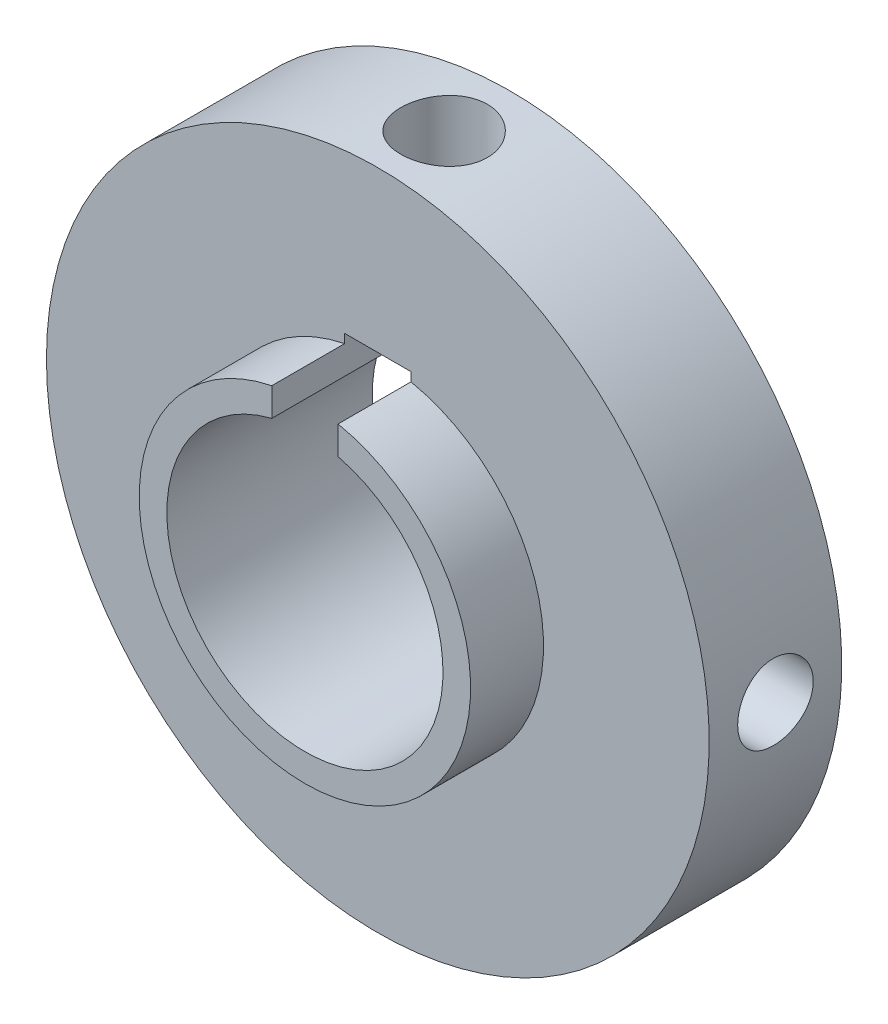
from build123d import *

# Parameters (mm, degrees)
EXTRUDE1_REACH      = 31.416
EXTRUDE2_REACH      = 31.416
EXTRUDE2_END_RADIUS = 19.05
SKETCH3_R           = 2.4892
EXTRUDE3_REACH      = 31.416
EXTRUDE3_END_RADIUS = 19.05
SKETCH4_R           = 2.1717


with BuildPart() as part:
    # Sketch1 → Revolve1 (revolve)
    with BuildSketch(Plane(origin=(0, 0, 0), x_dir=(1, 0, 0), z_dir=(0, 1, 0)), mode=Mode.PRIVATE) as revolve1_sk:
        Polygon((7.9375, 11.811), (7.9375, 0), (9.525, 0), (9.525, 4.191), (19.05, 4.191), (19.05, 11.811), align=None)
    revolve(revolve1_sk.sketch.rotate(Axis((0, 0, -72.820126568), (0, 0, 1)), 180), axis=Axis((0, 0, -72.820126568), (0, 0, 1)))

    # Extrude1: up to this face of the body (flat: up to its plane)
    extrude1_end = Plane(part.part.faces().sort_by_distance((8.206907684, 0, 0))[0])
    # Sketch2 → Extrude1 (cut, up to the picked face)
    with BuildSketch(Plane(origin=(0, 0, -11.811), x_dir=(-1, 0, 0), z_dir=(0, 0, -1)), mode=Mode.PRIVATE) as extrude1_sk1:
        with BuildLine():
            Line((1.905, 9.8425), (1.905, 7.705509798))
            ThreePointArc((1.905, 7.705509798), (0, -7.9375), (-1.905, 7.705509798))
            Line((-1.905, 7.705509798), (-1.905, 9.8425))
            Line((-1.905, 9.8425), (1.905, 9.8425))
        make_face()
    extrude1_tool1 = split(extrude(extrude1_sk1.sketch, amount=-EXTRUDE1_REACH, mode=Mode.PRIVATE), bisect_by=extrude1_end, keep=Keep.BOTH, mode=Mode.PRIVATE)
    add(extrude1_tool1.solids().sort_by(Axis((0, 0.325226, -11.811), (0, 0, 1)))[0], mode=Mode.SUBTRACT)

    # Extrude2: up to this cylinder (the profile starts inside it)
    extrude2_end = Plane(origin=(0, 0, -8.001), z_dir=(0, 0, -1)) * Cylinder(EXTRUDE2_END_RADIUS, 101.932, mode=Mode.PRIVATE)
    # Sketch3 → Extrude2 (cut, up to the surface)
    with BuildSketch(Plane(origin=(0, 0, 0), x_dir=(1, 0, 0), z_dir=(0, 1, 0)), mode=Mode.PRIVATE) as extrude2_sk1:
        with Locations(Location((0, 8.001, 0), (0, 0, 90))):
            Circle(SKETCH3_R)
    extrude2_tool1 = extrude(extrude2_sk1.sketch, amount=EXTRUDE2_REACH, mode=Mode.PRIVATE) & extrude2_end
    add(extrude2_tool1.solids().sort_by_distance((0, 0, -8.001))[0], mode=Mode.SUBTRACT)

    # Extrude3: up to this cylinder (the profile starts inside it)
    extrude3_end = Plane(origin=(0, 0, -8.001), z_dir=(0, 0, -1)) * Cylinder(EXTRUDE3_END_RADIUS, 101.932, mode=Mode.PRIVATE)
    # Sketch4 → Extrude3 (cut, up to the surface)
    with BuildSketch(Plane(origin=(0, 0, 0), x_dir=(0, 0, -1), z_dir=(1, 0, 0)), mode=Mode.PRIVATE) as extrude3_sk1:
        with Locations(Location((8.001, 0, 0), (0, 0, 180))):
            Circle(SKETCH4_R)
    extrude3_tool1 = extrude(extrude3_sk1.sketch, amount=EXTRUDE3_REACH, mode=Mode.PRIVATE) & extrude3_end
    add(extrude3_tool1.solids().sort_by_distance((0, 0, -8.001))[0], mode=Mode.SUBTRACT)


solid = part.part
